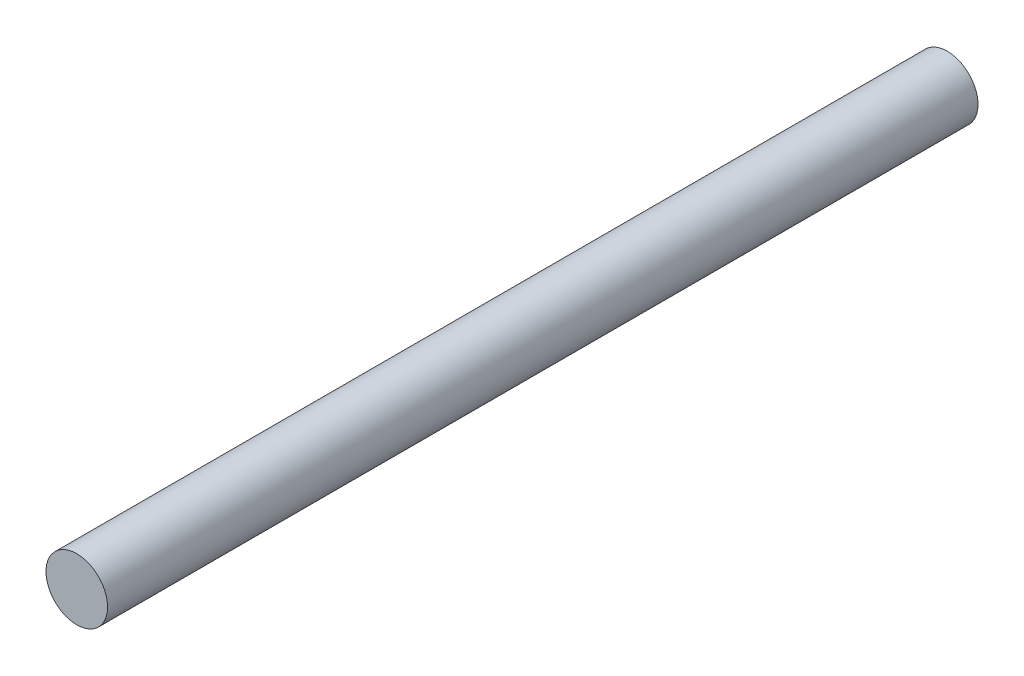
ISO-10303-21;
HEADER;
FILE_DESCRIPTION(('STEP AP214'),'2;1');
FILE_NAME('part.step','',(''),(''),'','','');
FILE_SCHEMA(('AUTOMOTIVE_DESIGN { 1 0 10303 214 1 1 1 1 }'));
ENDSEC;
DATA;
#1=APPLICATION_CONTEXT('core data for automotive mechanical design processes');
#2=APPLICATION_PROTOCOL_DEFINITION('international standard','automotive_design',2000,#1);
#3=PRODUCT_CONTEXT('',#1,'mechanical');
#4=PRODUCT('Part','Part','',(#3));
#5=PRODUCT_RELATED_PRODUCT_CATEGORY('part','',(#4));
#6=PRODUCT_DEFINITION_FORMATION('','',#4);
#7=PRODUCT_DEFINITION_CONTEXT('part definition',#1,'design');
#8=PRODUCT_DEFINITION('design','',#6,#7);
#9=PRODUCT_DEFINITION_SHAPE('','',#8);
#10=(LENGTH_UNIT() NAMED_UNIT(*) SI_UNIT(.MILLI.,.METRE.));
#11=(NAMED_UNIT(*) PLANE_ANGLE_UNIT() SI_UNIT($,.RADIAN.));
#12=(NAMED_UNIT(*) SI_UNIT($,.STERADIAN.) SOLID_ANGLE_UNIT());
#13=UNCERTAINTY_MEASURE_WITH_UNIT(LENGTH_MEASURE(1.E-05),#10,'distance_accuracy_value','');
#14=(GEOMETRIC_REPRESENTATION_CONTEXT(3) GLOBAL_UNCERTAINTY_ASSIGNED_CONTEXT((#13)) GLOBAL_UNIT_ASSIGNED_CONTEXT((#10,
#11,#12)) REPRESENTATION_CONTEXT('',''));
#15=CARTESIAN_POINT('',(0.,0.,0.));
#16=DIRECTION('',(0.,0.,1.));
#17=DIRECTION('',(1.,0.,0.));
#18=AXIS2_PLACEMENT_3D('',#15,#16,#17);
#19=CARTESIAN_POINT('',(0.,0.,424.));
#20=DIRECTION('',(0.,0.,1.));
#21=DIRECTION('',(0.,1.,0.));
#22=AXIS2_PLACEMENT_3D('',#19,#20,#21);
#23=PLANE('',#22);
#24=CARTESIAN_POINT('',(0.,0.,424.));
#25=DIRECTION('',(0.,0.,1.));
#26=DIRECTION('',(0.,1.,0.));
#27=AXIS2_PLACEMENT_3D('',#24,#25,#26);
#28=CIRCLE('',#27,15.);
#29=CARTESIAN_POINT('',(0.,15.,424.));
#30=VERTEX_POINT('',#29);
#31=EDGE_CURVE('E8',#30,#30,#28,.T.);
#32=ORIENTED_EDGE('',*,*,#31,.T.);
#33=EDGE_LOOP('',(#32));
#34=FACE_BOUND('',#33,.T.);
#35=ADVANCED_FACE('F12',(#34),#23,.T.);
#36=CARTESIAN_POINT('',(0.,0.,424.));
#37=DIRECTION('',(0.,0.,-1.));
#38=DIRECTION('',(0.,-1.,0.));
#39=AXIS2_PLACEMENT_3D('',#36,#37,#38);
#40=CYLINDRICAL_SURFACE('',#39,15.);
#41=ORIENTED_EDGE('',*,*,#31,.F.);
#42=EDGE_LOOP('',(#41));
#43=FACE_BOUND('',#42,.T.);
#44=CARTESIAN_POINT('',(0.,0.,0.));
#45=DIRECTION('',(0.,0.,1.));
#46=DIRECTION('',(0.,1.,0.));
#47=AXIS2_PLACEMENT_3D('',#44,#45,#46);
#48=CIRCLE('',#47,15.);
#49=CARTESIAN_POINT('',(0.,15.,0.));
#50=VERTEX_POINT('',#49);
#51=EDGE_CURVE('E16',#50,#50,#48,.T.);
#52=ORIENTED_EDGE('',*,*,#51,.T.);
#53=EDGE_LOOP('',(#52));
#54=FACE_BOUND('',#53,.T.);
#55=ADVANCED_FACE('F14',(#43,#54),#40,.T.);
#56=CARTESIAN_POINT('',(0.,0.,0.));
#57=DIRECTION('',(0.,0.,1.));
#58=DIRECTION('',(0.,1.,0.));
#59=AXIS2_PLACEMENT_3D('',#56,#57,#58);
#60=PLANE('',#59);
#61=ORIENTED_EDGE('',*,*,#51,.F.);
#62=EDGE_LOOP('',(#61));
#63=FACE_BOUND('',#62,.T.);
#64=ADVANCED_FACE('F26',(#63),#60,.F.);
#65=CLOSED_SHELL('',(#35,#55,#64));
#66=MANIFOLD_SOLID_BREP('B1',#65);
#67=ADVANCED_BREP_SHAPE_REPRESENTATION('',(#18,#66),#14);
#68=SHAPE_DEFINITION_REPRESENTATION(#9,#67);
ENDSEC;
END-ISO-10303-21;
